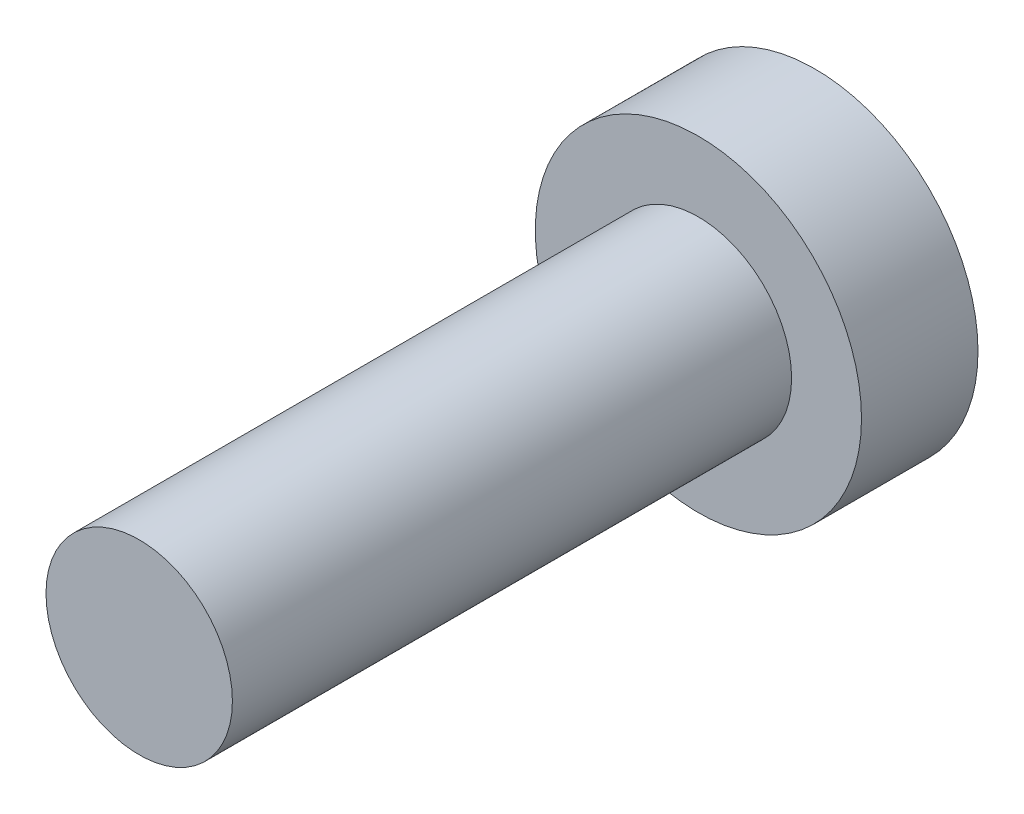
from build123d import *

# Parameters (mm, degrees)
ESQUISSE1_R              = 2
BASEEXTRUSION_DEPTH      = 12
ESQUISSE2_R              = 3.5
BOSSAGE_EXTRUSION1_DEPTH = 2.5


with BuildPart() as part:
    # Esquisse1 → BaseExtrusion (new body)
    with BuildSketch(Plane.XY):
        with Locations(Location((0, 0, 0), (0, 0, 180))):
            Circle(ESQUISSE1_R)
    extrude(amount=BASEEXTRUSION_DEPTH)

    # Esquisse2 → Bossage-Extrusion1 (add)
    with BuildSketch(Plane(origin=(0, 0, 0), x_dir=(-1, 0, 0), z_dir=(0, 0, -1))):
        with Locations(Location((0, 0, 0), (0, 0, 180))):
            Circle(ESQUISSE2_R)
    extrude(amount=BOSSAGE_EXTRUSION1_DEPTH)


solid = part.part
